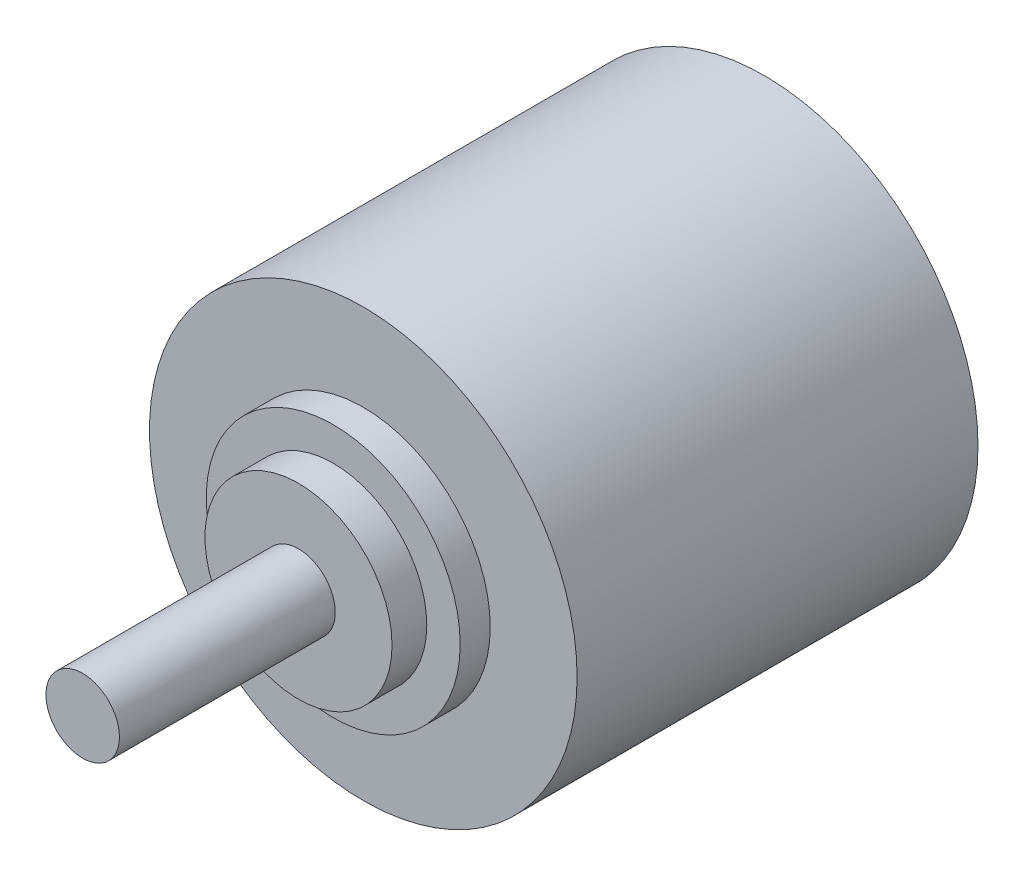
ISO-10303-21;
HEADER;
FILE_DESCRIPTION(('STEP AP214'),'2;1');
FILE_NAME('part.step','',(''),(''),'','','');
FILE_SCHEMA(('AUTOMOTIVE_DESIGN { 1 0 10303 214 1 1 1 1 }'));
ENDSEC;
DATA;
#1=APPLICATION_CONTEXT('core data for automotive mechanical design processes');
#2=APPLICATION_PROTOCOL_DEFINITION('international standard','automotive_design',2000,#1);
#3=PRODUCT_CONTEXT('',#1,'mechanical');
#4=PRODUCT('Part','Part','',(#3));
#5=PRODUCT_RELATED_PRODUCT_CATEGORY('part','',(#4));
#6=PRODUCT_DEFINITION_FORMATION('','',#4);
#7=PRODUCT_DEFINITION_CONTEXT('part definition',#1,'design');
#8=PRODUCT_DEFINITION('design','',#6,#7);
#9=PRODUCT_DEFINITION_SHAPE('','',#8);
#10=(LENGTH_UNIT() NAMED_UNIT(*) SI_UNIT(.MILLI.,.METRE.));
#11=(NAMED_UNIT(*) PLANE_ANGLE_UNIT() SI_UNIT($,.RADIAN.));
#12=(NAMED_UNIT(*) SI_UNIT($,.STERADIAN.) SOLID_ANGLE_UNIT());
#13=UNCERTAINTY_MEASURE_WITH_UNIT(LENGTH_MEASURE(1.E-05),#10,'distance_accuracy_value','');
#14=(GEOMETRIC_REPRESENTATION_CONTEXT(3) GLOBAL_UNCERTAINTY_ASSIGNED_CONTEXT((#13)) GLOBAL_UNIT_ASSIGNED_CONTEXT((#10,
#11,#12)) REPRESENTATION_CONTEXT('',''));
#15=CARTESIAN_POINT('',(0.,0.,0.));
#16=DIRECTION('',(0.,0.,1.));
#17=DIRECTION('',(1.,0.,0.));
#18=AXIS2_PLACEMENT_3D('',#15,#16,#17);
#19=CARTESIAN_POINT('',(-1.79059990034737,0.,34.85));
#20=DIRECTION('',(0.,0.,1.));
#21=DIRECTION('',(1.,0.,0.));
#22=AXIS2_PLACEMENT_3D('',#19,#20,#21);
#23=PLANE('',#22);
#24=CARTESIAN_POINT('',(-1.79059990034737,0.,34.85));
#25=DIRECTION('',(0.,0.,1.));
#26=DIRECTION('',(1.,0.,0.));
#27=AXIS2_PLACEMENT_3D('',#24,#25,#26);
#28=CIRCLE('',#27,7.);
#29=CARTESIAN_POINT('',(5.20940009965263,0.,34.85));
#30=VERTEX_POINT('',#29);
#31=EDGE_CURVE('E47',#30,#30,#28,.T.);
#32=ORIENTED_EDGE('',*,*,#31,.T.);
#33=EDGE_LOOP('',(#32));
#34=FACE_BOUND('',#33,.T.);
#35=CARTESIAN_POINT('',(-1.79059990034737,0.,34.85));
#36=DIRECTION('',(0.,0.,1.));
#37=DIRECTION('',(1.,0.,0.));
#38=AXIS2_PLACEMENT_3D('',#35,#36,#37);
#39=CIRCLE('',#38,2.75);
#40=CARTESIAN_POINT('',(0.95940009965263,0.,34.85));
#41=VERTEX_POINT('',#40);
#42=EDGE_CURVE('E56',#41,#41,#39,.T.);
#43=ORIENTED_EDGE('',*,*,#42,.F.);
#44=EDGE_LOOP('',(#43));
#45=FACE_BOUND('',#44,.T.);
#46=ADVANCED_FACE('F31',(#34,#45),#23,.T.);
#47=CARTESIAN_POINT('',(-1.79059990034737,0.,32.25));
#48=DIRECTION('',(0.,0.,1.));
#49=DIRECTION('',(1.,0.,0.));
#50=AXIS2_PLACEMENT_3D('',#47,#48,#49);
#51=PLANE('',#50);
#52=CARTESIAN_POINT('',(-1.79059990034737,0.,32.25));
#53=DIRECTION('',(0.,0.,1.));
#54=DIRECTION('',(1.,0.,0.));
#55=AXIS2_PLACEMENT_3D('',#52,#53,#54);
#56=CIRCLE('',#55,9.5);
#57=CARTESIAN_POINT('',(7.70940009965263,0.,32.25));
#58=VERTEX_POINT('',#57);
#59=EDGE_CURVE('E42',#58,#58,#56,.T.);
#60=ORIENTED_EDGE('',*,*,#59,.T.);
#61=EDGE_LOOP('',(#60));
#62=FACE_BOUND('',#61,.T.);
#63=CARTESIAN_POINT('',(-1.79059990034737,0.,32.25));
#64=DIRECTION('',(0.,0.,1.));
#65=DIRECTION('',(1.,0.,0.));
#66=AXIS2_PLACEMENT_3D('',#63,#64,#65);
#67=CIRCLE('',#66,7.);
#68=CARTESIAN_POINT('',(5.20940009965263,0.,32.25));
#69=VERTEX_POINT('',#68);
#70=EDGE_CURVE('E50',#69,#69,#67,.T.);
#71=ORIENTED_EDGE('',*,*,#70,.F.);
#72=EDGE_LOOP('',(#71));
#73=FACE_BOUND('',#72,.T.);
#74=ADVANCED_FACE('F107',(#62,#73),#51,.T.);
#75=CARTESIAN_POINT('',(-1.79059990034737,0.,30.));
#76=DIRECTION('',(0.,0.,1.));
#77=DIRECTION('',(1.,0.,0.));
#78=AXIS2_PLACEMENT_3D('',#75,#76,#77);
#79=PLANE('',#78);
#80=CARTESIAN_POINT('',(-1.79059990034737,0.,30.));
#81=DIRECTION('',(0.,0.,1.));
#82=DIRECTION('',(1.,0.,0.));
#83=AXIS2_PLACEMENT_3D('',#80,#81,#82);
#84=CIRCLE('',#83,16.);
#85=CARTESIAN_POINT('',(14.2094000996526,0.,30.));
#86=VERTEX_POINT('',#85);
#87=EDGE_CURVE('E10',#86,#86,#84,.T.);
#88=ORIENTED_EDGE('',*,*,#87,.T.);
#89=EDGE_LOOP('',(#88));
#90=FACE_BOUND('',#89,.T.);
#91=CARTESIAN_POINT('',(-1.79059990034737,0.,30.));
#92=DIRECTION('',(0.,0.,1.));
#93=DIRECTION('',(1.,0.,0.));
#94=AXIS2_PLACEMENT_3D('',#91,#92,#93);
#95=CIRCLE('',#94,9.5);
#96=CARTESIAN_POINT('',(7.70940009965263,0.,30.));
#97=VERTEX_POINT('',#96);
#98=EDGE_CURVE('E44',#97,#97,#95,.T.);
#99=ORIENTED_EDGE('',*,*,#98,.F.);
#100=EDGE_LOOP('',(#99));
#101=FACE_BOUND('',#100,.T.);
#102=ADVANCED_FACE('F102',(#90,#101),#79,.T.);
#103=CARTESIAN_POINT('',(-1.79059990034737,0.,30.));
#104=DIRECTION('',(0.,0.,-1.));
#105=DIRECTION('',(-1.,0.,0.));
#106=AXIS2_PLACEMENT_3D('',#103,#104,#105);
#107=CYLINDRICAL_SURFACE('',#106,16.);
#108=ORIENTED_EDGE('',*,*,#87,.F.);
#109=EDGE_LOOP('',(#108));
#110=FACE_BOUND('',#109,.T.);
#111=CARTESIAN_POINT('',(-1.79059990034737,0.,0.));
#112=DIRECTION('',(0.,0.,1.));
#113=DIRECTION('',(1.,0.,0.));
#114=AXIS2_PLACEMENT_3D('',#111,#112,#113);
#115=CIRCLE('',#114,16.);
#116=CARTESIAN_POINT('',(14.2094000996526,0.,0.));
#117=VERTEX_POINT('',#116);
#118=EDGE_CURVE('E35',#117,#117,#115,.T.);
#119=ORIENTED_EDGE('',*,*,#118,.T.);
#120=EDGE_LOOP('',(#119));
#121=FACE_BOUND('',#120,.T.);
#122=ADVANCED_FACE('F33',(#110,#121),#107,.T.);
#123=CARTESIAN_POINT('',(-1.79059990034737,0.,0.));
#124=DIRECTION('',(0.,0.,1.));
#125=DIRECTION('',(1.,0.,0.));
#126=AXIS2_PLACEMENT_3D('',#123,#124,#125);
#127=PLANE('',#126);
#128=CARTESIAN_POINT('',(-1.79059990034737,0.,0.));
#129=DIRECTION('',(0.,0.,-1.));
#130=DIRECTION('',(-1.,0.,0.));
#131=AXIS2_PLACEMENT_3D('',#128,#129,#130);
#132=CIRCLE('',#131,5.);
#133=CARTESIAN_POINT('',(-6.79059990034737,0.,0.));
#134=VERTEX_POINT('',#133);
#135=EDGE_CURVE('E62',#134,#134,#132,.T.);
#136=ORIENTED_EDGE('',*,*,#135,.F.);
#137=EDGE_LOOP('',(#136));
#138=FACE_BOUND('',#137,.T.);
#139=ORIENTED_EDGE('',*,*,#118,.F.);
#140=EDGE_LOOP('',(#139));
#141=FACE_BOUND('',#140,.T.);
#142=ADVANCED_FACE('F95',(#138,#141),#127,.F.);
#143=CARTESIAN_POINT('',(-1.79059990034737,0.,32.25));
#144=DIRECTION('',(0.,0.,-1.));
#145=DIRECTION('',(-1.,0.,0.));
#146=AXIS2_PLACEMENT_3D('',#143,#144,#145);
#147=CYLINDRICAL_SURFACE('',#146,9.5);
#148=ORIENTED_EDGE('',*,*,#59,.F.);
#149=EDGE_LOOP('',(#148));
#150=FACE_BOUND('',#149,.T.);
#151=ORIENTED_EDGE('',*,*,#98,.T.);
#152=EDGE_LOOP('',(#151));
#153=FACE_BOUND('',#152,.T.);
#154=ADVANCED_FACE('F98',(#150,#153),#147,.T.);
#155=CARTESIAN_POINT('',(-1.79059990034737,0.,34.85));
#156=DIRECTION('',(0.,0.,-1.));
#157=DIRECTION('',(-1.,0.,0.));
#158=AXIS2_PLACEMENT_3D('',#155,#156,#157);
#159=CYLINDRICAL_SURFACE('',#158,7.);
#160=ORIENTED_EDGE('',*,*,#31,.F.);
#161=EDGE_LOOP('',(#160));
#162=FACE_BOUND('',#161,.T.);
#163=ORIENTED_EDGE('',*,*,#70,.T.);
#164=EDGE_LOOP('',(#163));
#165=FACE_BOUND('',#164,.T.);
#166=ADVANCED_FACE('F122',(#162,#165),#159,.T.);
#167=CARTESIAN_POINT('',(-1.79059990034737,0.,51.));
#168=DIRECTION('',(0.,0.,-1.));
#169=DIRECTION('',(-1.,0.,0.));
#170=AXIS2_PLACEMENT_3D('',#167,#168,#169);
#171=CYLINDRICAL_SURFACE('',#170,2.75);
#172=CARTESIAN_POINT('',(-1.79059990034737,0.,51.));
#173=DIRECTION('',(0.,0.,1.));
#174=DIRECTION('',(1.,0.,0.));
#175=AXIS2_PLACEMENT_3D('',#172,#173,#174);
#176=CIRCLE('',#175,2.75);
#177=CARTESIAN_POINT('',(0.95940009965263,0.,51.));
#178=VERTEX_POINT('',#177);
#179=EDGE_CURVE('E53',#178,#178,#176,.T.);
#180=ORIENTED_EDGE('',*,*,#179,.F.);
#181=EDGE_LOOP('',(#180));
#182=FACE_BOUND('',#181,.T.);
#183=ORIENTED_EDGE('',*,*,#42,.T.);
#184=EDGE_LOOP('',(#183));
#185=FACE_BOUND('',#184,.T.);
#186=ADVANCED_FACE('F120',(#182,#185),#171,.T.);
#187=CARTESIAN_POINT('',(-1.79059990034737,0.,51.));
#188=DIRECTION('',(0.,0.,1.));
#189=DIRECTION('',(1.,0.,0.));
#190=AXIS2_PLACEMENT_3D('',#187,#188,#189);
#191=PLANE('',#190);
#192=ORIENTED_EDGE('',*,*,#179,.T.);
#193=EDGE_LOOP('',(#192));
#194=FACE_BOUND('',#193,.T.);
#195=ADVANCED_FACE('F91',(#194),#191,.T.);
#196=CARTESIAN_POINT('',(-1.79059990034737,0.,2.));
#197=DIRECTION('',(0.,0.,-1.));
#198=DIRECTION('',(-1.,0.,0.));
#199=AXIS2_PLACEMENT_3D('',#196,#197,#198);
#200=CYLINDRICAL_SURFACE('',#199,5.);
#201=CARTESIAN_POINT('',(-1.79059990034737,0.,2.));
#202=DIRECTION('',(0.,0.,-1.));
#203=DIRECTION('',(-1.,0.,0.));
#204=AXIS2_PLACEMENT_3D('',#201,#202,#203);
#205=CIRCLE('',#204,5.);
#206=CARTESIAN_POINT('',(-6.79059990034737,0.,2.));
#207=VERTEX_POINT('',#206);
#208=EDGE_CURVE('E59',#207,#207,#205,.T.);
#209=ORIENTED_EDGE('',*,*,#208,.F.);
#210=EDGE_LOOP('',(#209));
#211=FACE_BOUND('',#210,.T.);
#212=ORIENTED_EDGE('',*,*,#135,.T.);
#213=EDGE_LOOP('',(#212));
#214=FACE_BOUND('',#213,.T.);
#215=ADVANCED_FACE('F85',(#211,#214),#200,.F.);
#216=CARTESIAN_POINT('',(-1.79059990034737,0.,2.));
#217=DIRECTION('',(0.,0.,-1.));
#218=DIRECTION('',(-1.,0.,0.));
#219=AXIS2_PLACEMENT_3D('',#216,#217,#218);
#220=PLANE('',#219);
#221=CARTESIAN_POINT('',(-1.79059990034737,0.,2.));
#222=DIRECTION('',(0.,0.,-1.));
#223=DIRECTION('',(-1.,0.,0.));
#224=AXIS2_PLACEMENT_3D('',#221,#222,#223);
#225=CIRCLE('',#224,1.5);
#226=CARTESIAN_POINT('',(-3.29059990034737,0.,2.));
#227=VERTEX_POINT('',#226);
#228=EDGE_CURVE('E68',#227,#227,#225,.T.);
#229=ORIENTED_EDGE('',*,*,#228,.F.);
#230=EDGE_LOOP('',(#229));
#231=FACE_BOUND('',#230,.T.);
#232=ORIENTED_EDGE('',*,*,#208,.T.);
#233=EDGE_LOOP('',(#232));
#234=FACE_BOUND('',#233,.T.);
#235=ADVANCED_FACE('F79',(#231,#234),#220,.T.);
#236=CARTESIAN_POINT('',(-1.79059990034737,0.,11.));
#237=DIRECTION('',(0.,0.,-1.));
#238=DIRECTION('',(-1.,0.,0.));
#239=AXIS2_PLACEMENT_3D('',#236,#237,#238);
#240=CYLINDRICAL_SURFACE('',#239,1.5);
#241=CARTESIAN_POINT('',(-1.79059990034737,0.,11.));
#242=DIRECTION('',(0.,0.,-1.));
#243=DIRECTION('',(-1.,0.,0.));
#244=AXIS2_PLACEMENT_3D('',#241,#242,#243);
#245=CIRCLE('',#244,1.5);
#246=CARTESIAN_POINT('',(-3.29059990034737,0.,11.));
#247=VERTEX_POINT('',#246);
#248=EDGE_CURVE('E65',#247,#247,#245,.T.);
#249=ORIENTED_EDGE('',*,*,#248,.F.);
#250=EDGE_LOOP('',(#249));
#251=FACE_BOUND('',#250,.T.);
#252=ORIENTED_EDGE('',*,*,#228,.T.);
#253=EDGE_LOOP('',(#252));
#254=FACE_BOUND('',#253,.T.);
#255=ADVANCED_FACE('F76',(#251,#254),#240,.F.);
#256=CARTESIAN_POINT('',(-1.79059990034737,0.,11.));
#257=DIRECTION('',(0.,0.,-1.));
#258=DIRECTION('',(-1.,0.,0.));
#259=AXIS2_PLACEMENT_3D('',#256,#257,#258);
#260=PLANE('',#259);
#261=ORIENTED_EDGE('',*,*,#248,.T.);
#262=EDGE_LOOP('',(#261));
#263=FACE_BOUND('',#262,.T.);
#264=ADVANCED_FACE('F74',(#263),#260,.T.);
#265=CLOSED_SHELL('',(#46,#74,#102,#122,#142,#154,#166,#186,#195,#215,#235,#255,#264));
#266=MANIFOLD_SOLID_BREP('B2',#265);
#267=ADVANCED_BREP_SHAPE_REPRESENTATION('',(#18,#266),#14);
#268=SHAPE_DEFINITION_REPRESENTATION(#9,#267);
ENDSEC;
END-ISO-10303-21;
